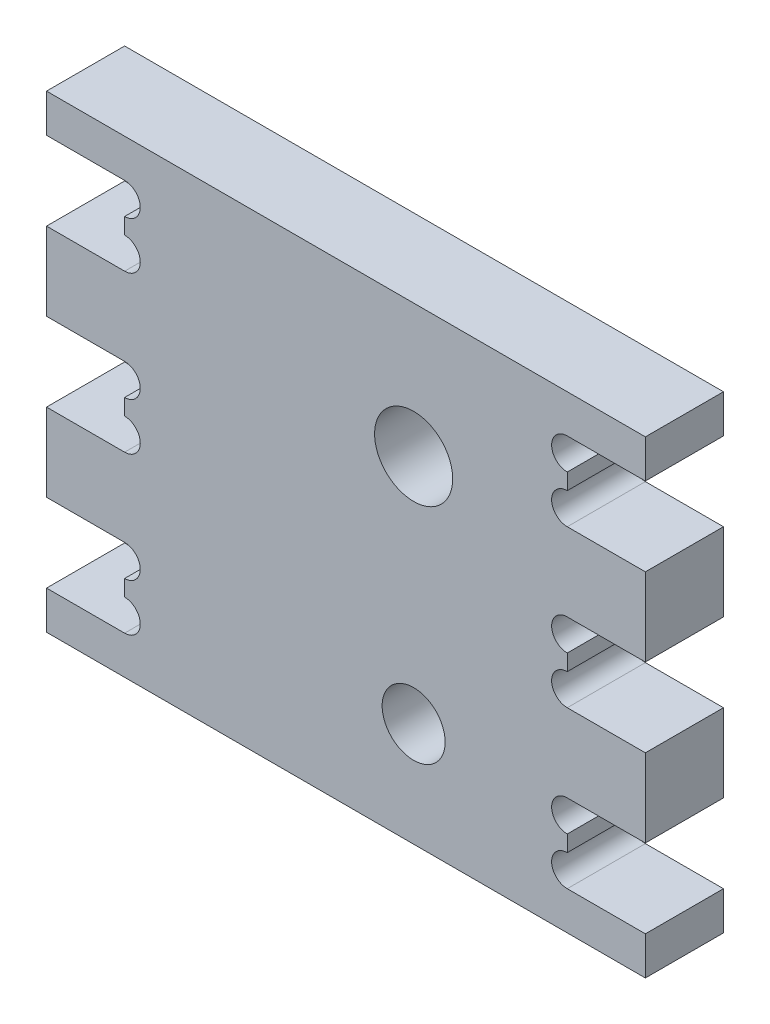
from build123d import *

# Parameters (mm, degrees)
OUTLINE_DEPTH = 15
SKIZZE2_R     = 7.5
SKIZZE2_R_2   = 6.05
INNER_DEPTH   = 15


with BuildPart() as part:
    # Skizze1 → outline (new body)
    with BuildSketch(Plane.XY):
        with BuildLine():
            Line((15, 82.65), (0, 82.65))
            Line((0, 82.65), (0, 90))
            Line((0, 90), (115, 90))
            Line((115, 90), (115, 82.65))
            Line((115, 82.65), (100, 82.65))
            ThreePointArc((100, 82.65), (97, 79.65), (100, 76.65))
            Line((100, 76.65), (100, 73.55))
            ThreePointArc((100, 73.55), (97, 70.55), (100, 67.55))
            Line((100, 67.55), (115, 67.55))
            Line((115, 67.55), (115, 52.55))
            Line((115, 52.55), (100, 52.55))
            ThreePointArc((100, 52.55), (97, 49.55), (100, 46.55))
            Line((100, 46.55), (100, 43.45))
            ThreePointArc((100, 43.45), (97, 40.45), (100, 37.45))
            Line((100, 37.45), (115, 37.45))
            Line((115, 37.45), (115, 22.45))
            Line((115, 22.45), (100, 22.45))
            ThreePointArc((100, 22.45), (97, 19.45), (100, 16.45))
            Line((100, 16.45), (100, 13.35))
            ThreePointArc((100, 13.35), (97, 10.35), (100, 7.35))
            Line((100, 7.35), (115, 7.35))
            Line((115, 7.35), (115, 0))
            Line((115, 0), (0, 0))
            Line((0, 0), (0, 7.35))
            Line((0, 7.35), (15, 7.35))
            ThreePointArc((15, 7.35), (18, 10.35), (15, 13.35))
            Line((15, 13.35), (15, 16.45))
            ThreePointArc((15, 16.45), (18, 19.45), (15, 22.45))
            Line((15, 22.45), (0, 22.45))
            Line((0, 22.45), (0, 37.45))
            Line((0, 37.45), (15, 37.45))
            ThreePointArc((15, 37.45), (18, 40.45), (15, 43.45))
            Line((15, 43.45), (15, 46.55))
            ThreePointArc((15, 46.55), (18, 49.55), (15, 52.55))
            Line((15, 52.55), (0, 52.55))
            Line((0, 52.55), (0, 67.55))
            Line((0, 67.55), (15, 67.55))
            ThreePointArc((15, 67.55), (18, 70.55), (15, 73.55))
            Line((15, 73.55), (15, 76.65))
            ThreePointArc((15, 76.65), (18, 79.65), (15, 82.65))
        make_face()
    extrude(amount=OUTLINE_DEPTH)

    # Skizze2 → inner (cut)
    with BuildSketch(Plane.XY.offset(15)):
        with Locations((70.5, 64.5)):
            Circle(SKIZZE2_R)
        with Locations((70.5, 20)):
            Circle(SKIZZE2_R_2)
    extrude(amount=-INNER_DEPTH, mode=Mode.SUBTRACT)


solid = part.part
